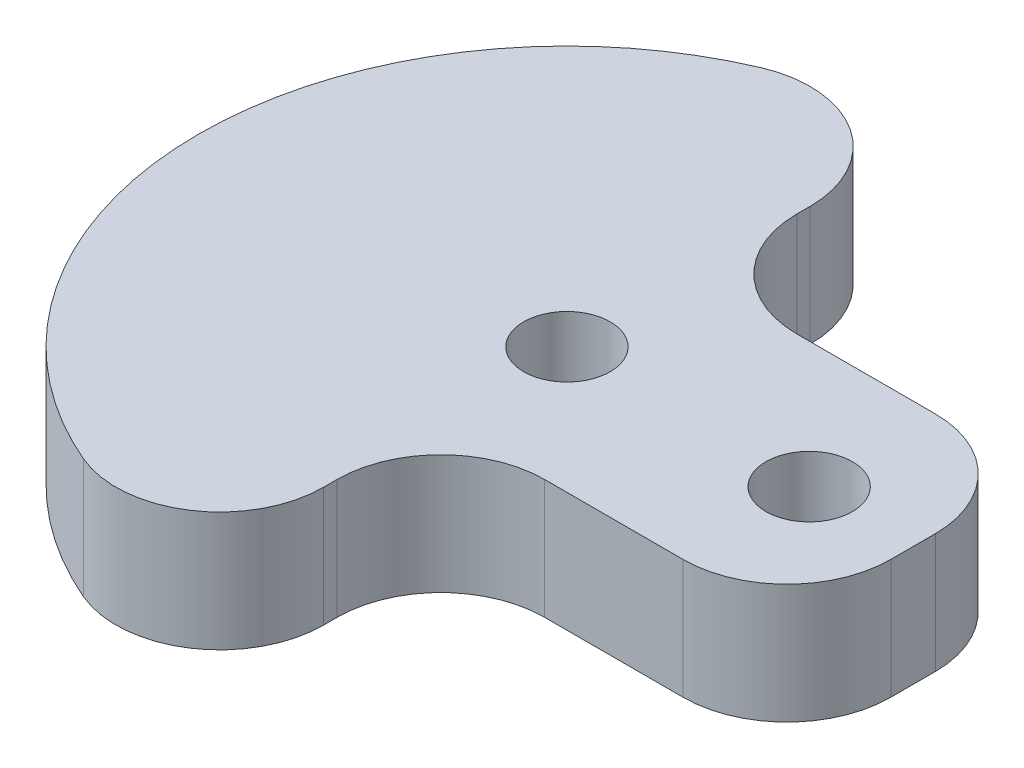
ISO-10303-21;
HEADER;
FILE_DESCRIPTION(('STEP AP214'),'2;1');
FILE_NAME('part.step','',(''),(''),'','','');
FILE_SCHEMA(('AUTOMOTIVE_DESIGN { 1 0 10303 214 1 1 1 1 }'));
ENDSEC;
DATA;
#1=APPLICATION_CONTEXT('core data for automotive mechanical design processes');
#2=APPLICATION_PROTOCOL_DEFINITION('international standard','automotive_design',2000,#1);
#3=PRODUCT_CONTEXT('',#1,'mechanical');
#4=PRODUCT('Part','Part','',(#3));
#5=PRODUCT_RELATED_PRODUCT_CATEGORY('part','',(#4));
#6=PRODUCT_DEFINITION_FORMATION('','',#4);
#7=PRODUCT_DEFINITION_CONTEXT('part definition',#1,'design');
#8=PRODUCT_DEFINITION('design','',#6,#7);
#9=PRODUCT_DEFINITION_SHAPE('','',#8);
#10=(LENGTH_UNIT() NAMED_UNIT(*) SI_UNIT(.MILLI.,.METRE.));
#11=(NAMED_UNIT(*) PLANE_ANGLE_UNIT() SI_UNIT($,.RADIAN.));
#12=(NAMED_UNIT(*) SI_UNIT($,.STERADIAN.) SOLID_ANGLE_UNIT());
#13=UNCERTAINTY_MEASURE_WITH_UNIT(LENGTH_MEASURE(1.E-05),#10,'distance_accuracy_value','');
#14=(GEOMETRIC_REPRESENTATION_CONTEXT(3) GLOBAL_UNCERTAINTY_ASSIGNED_CONTEXT((#13)) GLOBAL_UNIT_ASSIGNED_CONTEXT((#10,
#11,#12)) REPRESENTATION_CONTEXT('',''));
#15=CARTESIAN_POINT('',(0.,0.,0.));
#16=DIRECTION('',(0.,0.,1.));
#17=DIRECTION('',(1.,0.,0.));
#18=AXIS2_PLACEMENT_3D('',#15,#16,#17);
#19=CARTESIAN_POINT('',(7.62,8.763,16.8728571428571));
#20=DIRECTION('',(0.,1.,0.));
#21=DIRECTION('',(0.,0.,1.));
#22=AXIS2_PLACEMENT_3D('',#19,#20,#21);
#23=PLANE('',#22);
#24=CARTESIAN_POINT('',(0.,8.763,0.));
#25=DIRECTION('',(0.,1.,0.));
#26=DIRECTION('',(0.,0.,1.));
#27=AXIS2_PLACEMENT_3D('',#24,#25,#26);
#28=CIRCLE('',#27,3.175);
#29=CARTESIAN_POINT('',(0.,8.763,3.175));
#30=VERTEX_POINT('',#29);
#31=EDGE_CURVE('E157',#30,#30,#28,.T.);
#32=ORIENTED_EDGE('',*,*,#31,.F.);
#33=EDGE_LOOP('',(#32));
#34=FACE_BOUND('',#33,.T.);
#35=CARTESIAN_POINT('',(7.62,8.763,16.8728571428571));
#36=DIRECTION('',(0.,-1.,0.));
#37=DIRECTION('',(0.,0.,1.));
#38=AXIS2_PLACEMENT_3D('',#35,#36,#37);
#39=CIRCLE('',#38,7.62);
#40=CARTESIAN_POINT('',(0.,8.763,16.8728571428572));
#41=VERTEX_POINT('',#40);
#42=CARTESIAN_POINT('',(7.62000000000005,8.763,9.25285714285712));
#43=VERTEX_POINT('',#42);
#44=EDGE_CURVE('E176',#41,#43,#39,.T.);
#45=ORIENTED_EDGE('',*,*,#44,.T.);
#46=DIRECTION('',(1.,0.,0.));
#47=VECTOR('',#46,1.);
#48=CARTESIAN_POINT('',(17.7799999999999,8.763,9.25285714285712));
#49=LINE('',#48,#47);
#50=CARTESIAN_POINT('',(17.7799999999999,8.763,9.25285714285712));
#51=VERTEX_POINT('',#50);
#52=EDGE_CURVE('E104',#43,#51,#49,.T.);
#53=ORIENTED_EDGE('',*,*,#52,.T.);
#54=CARTESIAN_POINT('',(17.78,8.763,1.63285714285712));
#55=DIRECTION('',(0.,1.,0.));
#56=DIRECTION('',(0.,0.,-1.));
#57=AXIS2_PLACEMENT_3D('',#54,#55,#56);
#58=CIRCLE('',#57,7.62);
#59=CARTESIAN_POINT('',(25.4,8.763,1.63285714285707));
#60=VERTEX_POINT('',#59);
#61=EDGE_CURVE('E203',#51,#60,#58,.T.);
#62=ORIENTED_EDGE('',*,*,#61,.T.);
#63=DIRECTION('',(0.,0.,-1.));
#64=VECTOR('',#63,1.);
#65=CARTESIAN_POINT('',(25.4,8.763,-1.63285714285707));
#66=LINE('',#65,#64);
#67=CARTESIAN_POINT('',(25.4,8.763,-1.63285714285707));
#68=VERTEX_POINT('',#67);
#69=EDGE_CURVE('E222',#60,#68,#66,.T.);
#70=ORIENTED_EDGE('',*,*,#69,.T.);
#71=CARTESIAN_POINT('',(17.78,8.763,-1.63285714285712));
#72=DIRECTION('',(0.,1.,0.));
#73=DIRECTION('',(0.,0.,-1.));
#74=AXIS2_PLACEMENT_3D('',#71,#72,#73);
#75=CIRCLE('',#74,7.62);
#76=CARTESIAN_POINT('',(17.7799999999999,8.763,-9.25285714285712));
#77=VERTEX_POINT('',#76);
#78=EDGE_CURVE('E219',#68,#77,#75,.T.);
#79=ORIENTED_EDGE('',*,*,#78,.T.);
#80=DIRECTION('',(-1.,0.,0.));
#81=VECTOR('',#80,1.);
#82=CARTESIAN_POINT('',(7.62000000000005,8.763,-9.25285714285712));
#83=LINE('',#82,#81);
#84=CARTESIAN_POINT('',(7.62000000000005,8.763,-9.25285714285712));
#85=VERTEX_POINT('',#84);
#86=EDGE_CURVE('E221',#77,#85,#83,.T.);
#87=ORIENTED_EDGE('',*,*,#86,.T.);
#88=CARTESIAN_POINT('',(7.62,8.763,-16.8728571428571));
#89=DIRECTION('',(0.,-1.,0.));
#90=DIRECTION('',(0.,0.,1.));
#91=AXIS2_PLACEMENT_3D('',#88,#89,#90);
#92=CIRCLE('',#91,7.62);
#93=CARTESIAN_POINT('',(0.,8.763,-16.8728571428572));
#94=VERTEX_POINT('',#93);
#95=EDGE_CURVE('E224',#85,#94,#92,.T.);
#96=ORIENTED_EDGE('',*,*,#95,.T.);
#97=DIRECTION('',(0.,0.,-1.));
#98=VECTOR('',#97,1.);
#99=CARTESIAN_POINT('',(0.,8.763,-17.8548207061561));
#100=LINE('',#99,#98);
#101=CARTESIAN_POINT('',(0.,8.763,-17.8548207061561));
#102=VERTEX_POINT('',#101);
#103=EDGE_CURVE('E230',#94,#102,#100,.T.);
#104=ORIENTED_EDGE('',*,*,#103,.T.);
#105=CARTESIAN_POINT('',(-7.62,8.763,-17.8548207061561));
#106=DIRECTION('',(0.,1.,0.));
#107=DIRECTION('',(0.,0.,-1.));
#108=AXIS2_PLACEMENT_3D('',#105,#106,#107);
#109=CIRCLE('',#108,7.62);
#110=CARTESIAN_POINT('',(-10.6110280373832,8.763,-24.8632550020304));
#111=VERTEX_POINT('',#110);
#112=EDGE_CURVE('E135',#102,#111,#109,.T.);
#113=ORIENTED_EDGE('',*,*,#112,.T.);
#114=CARTESIAN_POINT('',(0.,8.763,0.));
#115=DIRECTION('',(0.,1.,0.));
#116=DIRECTION('',(0.,0.,-1.));
#117=AXIS2_PLACEMENT_3D('',#114,#115,#116);
#118=CIRCLE('',#117,27.0328571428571);
#119=CARTESIAN_POINT('',(-10.6110280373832,8.763,24.8632550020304));
#120=VERTEX_POINT('',#119);
#121=EDGE_CURVE('E129',#111,#120,#118,.T.);
#122=ORIENTED_EDGE('',*,*,#121,.T.);
#123=CARTESIAN_POINT('',(-7.62,8.763,17.8548207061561));
#124=DIRECTION('',(0.,1.,0.));
#125=DIRECTION('',(0.,0.,1.));
#126=AXIS2_PLACEMENT_3D('',#123,#124,#125);
#127=CIRCLE('',#126,7.62);
#128=CARTESIAN_POINT('',(0.,8.763,17.8548207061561));
#129=VERTEX_POINT('',#128);
#130=EDGE_CURVE('E133',#120,#129,#127,.T.);
#131=ORIENTED_EDGE('',*,*,#130,.T.);
#132=DIRECTION('',(0.,0.,-1.));
#133=VECTOR('',#132,1.);
#134=CARTESIAN_POINT('',(0.,8.763,16.8728571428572));
#135=LINE('',#134,#133);
#136=EDGE_CURVE('E49',#129,#41,#135,.T.);
#137=ORIENTED_EDGE('',*,*,#136,.T.);
#138=EDGE_LOOP('',(#45,#53,#62,#70,#79,#87,#96,#104,#113,#122,#131,#137));
#139=FACE_BOUND('',#138,.T.);
#140=CARTESIAN_POINT('',(17.78,8.763,0.));
#141=DIRECTION('',(0.,1.,0.));
#142=DIRECTION('',(0.,0.,1.));
#143=AXIS2_PLACEMENT_3D('',#140,#141,#142);
#144=CIRCLE('',#143,3.175);
#145=CARTESIAN_POINT('',(17.78,8.763,3.175));
#146=VERTEX_POINT('',#145);
#147=EDGE_CURVE('E273',#146,#146,#144,.T.);
#148=ORIENTED_EDGE('',*,*,#147,.F.);
#149=EDGE_LOOP('',(#148));
#150=FACE_BOUND('',#149,.T.);
#151=ADVANCED_FACE('F32',(#34,#139,#150),#23,.T.);
#152=CARTESIAN_POINT('',(7.62,0.,16.8728571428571));
#153=DIRECTION('',(0.,1.,0.));
#154=DIRECTION('',(0.,0.,1.));
#155=AXIS2_PLACEMENT_3D('',#152,#153,#154);
#156=PLANE('',#155);
#157=CARTESIAN_POINT('',(0.,0.,0.));
#158=DIRECTION('',(0.,1.,0.));
#159=DIRECTION('',(0.,0.,1.));
#160=AXIS2_PLACEMENT_3D('',#157,#158,#159);
#161=CIRCLE('',#160,3.175);
#162=CARTESIAN_POINT('',(0.,0.,3.175));
#163=VERTEX_POINT('',#162);
#164=EDGE_CURVE('E278',#163,#163,#161,.T.);
#165=ORIENTED_EDGE('',*,*,#164,.T.);
#166=EDGE_LOOP('',(#165));
#167=FACE_BOUND('',#166,.T.);
#168=CARTESIAN_POINT('',(7.62,0.,16.8728571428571));
#169=DIRECTION('',(0.,-1.,0.));
#170=DIRECTION('',(0.,0.,1.));
#171=AXIS2_PLACEMENT_3D('',#168,#169,#170);
#172=CIRCLE('',#171,7.62);
#173=CARTESIAN_POINT('',(0.,0.,16.8728571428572));
#174=VERTEX_POINT('',#173);
#175=CARTESIAN_POINT('',(7.62000000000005,0.,9.25285714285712));
#176=VERTEX_POINT('',#175);
#177=EDGE_CURVE('E153',#174,#176,#172,.T.);
#178=ORIENTED_EDGE('',*,*,#177,.F.);
#179=DIRECTION('',(0.,0.,-1.));
#180=VECTOR('',#179,1.);
#181=CARTESIAN_POINT('',(0.,0.,16.8728571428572));
#182=LINE('',#181,#180);
#183=CARTESIAN_POINT('',(0.,0.,17.8548207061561));
#184=VERTEX_POINT('',#183);
#185=EDGE_CURVE('E96',#184,#174,#182,.T.);
#186=ORIENTED_EDGE('',*,*,#185,.F.);
#187=CARTESIAN_POINT('',(-7.62,0.,17.8548207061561));
#188=DIRECTION('',(0.,1.,0.));
#189=DIRECTION('',(0.,0.,1.));
#190=AXIS2_PLACEMENT_3D('',#187,#188,#189);
#191=CIRCLE('',#190,7.62);
#192=CARTESIAN_POINT('',(-10.6110280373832,0.,24.8632550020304));
#193=VERTEX_POINT('',#192);
#194=EDGE_CURVE('E90',#193,#184,#191,.T.);
#195=ORIENTED_EDGE('',*,*,#194,.F.);
#196=CARTESIAN_POINT('',(0.,0.,0.));
#197=DIRECTION('',(0.,1.,0.));
#198=DIRECTION('',(0.,0.,-1.));
#199=AXIS2_PLACEMENT_3D('',#196,#197,#198);
#200=CIRCLE('',#199,27.0328571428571);
#201=CARTESIAN_POINT('',(-10.6110280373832,0.,-24.8632550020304));
#202=VERTEX_POINT('',#201);
#203=EDGE_CURVE('E143',#202,#193,#200,.T.);
#204=ORIENTED_EDGE('',*,*,#203,.F.);
#205=CARTESIAN_POINT('',(-7.62,0.,-17.8548207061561));
#206=DIRECTION('',(0.,1.,0.));
#207=DIRECTION('',(0.,0.,-1.));
#208=AXIS2_PLACEMENT_3D('',#205,#206,#207);
#209=CIRCLE('',#208,7.62);
#210=CARTESIAN_POINT('',(0.,0.,-17.8548207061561));
#211=VERTEX_POINT('',#210);
#212=EDGE_CURVE('E171',#211,#202,#209,.T.);
#213=ORIENTED_EDGE('',*,*,#212,.F.);
#214=DIRECTION('',(0.,0.,-1.));
#215=VECTOR('',#214,1.);
#216=CARTESIAN_POINT('',(0.,0.,-17.8548207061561));
#217=LINE('',#216,#215);
#218=CARTESIAN_POINT('',(0.,0.,-16.8728571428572));
#219=VERTEX_POINT('',#218);
#220=EDGE_CURVE('E169',#219,#211,#217,.T.);
#221=ORIENTED_EDGE('',*,*,#220,.F.);
#222=CARTESIAN_POINT('',(7.62,0.,-16.8728571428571));
#223=DIRECTION('',(0.,-1.,0.));
#224=DIRECTION('',(0.,0.,1.));
#225=AXIS2_PLACEMENT_3D('',#222,#223,#224);
#226=CIRCLE('',#225,7.62);
#227=CARTESIAN_POINT('',(7.62000000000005,0.,-9.25285714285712));
#228=VERTEX_POINT('',#227);
#229=EDGE_CURVE('E167',#228,#219,#226,.T.);
#230=ORIENTED_EDGE('',*,*,#229,.F.);
#231=DIRECTION('',(-1.,0.,0.));
#232=VECTOR('',#231,1.);
#233=CARTESIAN_POINT('',(7.62000000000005,0.,-9.25285714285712));
#234=LINE('',#233,#232);
#235=CARTESIAN_POINT('',(17.7799999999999,0.,-9.25285714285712));
#236=VERTEX_POINT('',#235);
#237=EDGE_CURVE('E165',#236,#228,#234,.T.);
#238=ORIENTED_EDGE('',*,*,#237,.F.);
#239=CARTESIAN_POINT('',(17.78,0.,-1.63285714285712));
#240=DIRECTION('',(0.,1.,0.));
#241=DIRECTION('',(0.,0.,-1.));
#242=AXIS2_PLACEMENT_3D('',#239,#240,#241);
#243=CIRCLE('',#242,7.62);
#244=CARTESIAN_POINT('',(25.4,0.,-1.63285714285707));
#245=VERTEX_POINT('',#244);
#246=EDGE_CURVE('E163',#245,#236,#243,.T.);
#247=ORIENTED_EDGE('',*,*,#246,.F.);
#248=DIRECTION('',(0.,0.,-1.));
#249=VECTOR('',#248,1.);
#250=CARTESIAN_POINT('',(25.4,0.,-1.63285714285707));
#251=LINE('',#250,#249);
#252=CARTESIAN_POINT('',(25.4,0.,1.63285714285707));
#253=VERTEX_POINT('',#252);
#254=EDGE_CURVE('E161',#253,#245,#251,.T.);
#255=ORIENTED_EDGE('',*,*,#254,.F.);
#256=CARTESIAN_POINT('',(17.78,0.,1.63285714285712));
#257=DIRECTION('',(0.,1.,0.));
#258=DIRECTION('',(0.,0.,-1.));
#259=AXIS2_PLACEMENT_3D('',#256,#257,#258);
#260=CIRCLE('',#259,7.62);
#261=CARTESIAN_POINT('',(17.7799999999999,0.,9.25285714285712));
#262=VERTEX_POINT('',#261);
#263=EDGE_CURVE('E159',#262,#253,#260,.T.);
#264=ORIENTED_EDGE('',*,*,#263,.F.);
#265=DIRECTION('',(1.,0.,0.));
#266=VECTOR('',#265,1.);
#267=CARTESIAN_POINT('',(17.7799999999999,0.,9.25285714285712));
#268=LINE('',#267,#266);
#269=EDGE_CURVE('E156',#176,#262,#268,.T.);
#270=ORIENTED_EDGE('',*,*,#269,.F.);
#271=EDGE_LOOP('',(#178,#186,#195,#204,#213,#221,#230,#238,#247,#255,#264,#270));
#272=FACE_BOUND('',#271,.T.);
#273=CARTESIAN_POINT('',(17.78,0.,0.));
#274=DIRECTION('',(0.,1.,0.));
#275=DIRECTION('',(0.,0.,1.));
#276=AXIS2_PLACEMENT_3D('',#273,#274,#275);
#277=CIRCLE('',#276,3.175);
#278=CARTESIAN_POINT('',(17.78,0.,3.175));
#279=VERTEX_POINT('',#278);
#280=EDGE_CURVE('E276',#279,#279,#277,.T.);
#281=ORIENTED_EDGE('',*,*,#280,.T.);
#282=EDGE_LOOP('',(#281));
#283=FACE_BOUND('',#282,.T.);
#284=ADVANCED_FACE('F207',(#167,#272,#283),#156,.F.);
#285=CARTESIAN_POINT('',(7.62,8.763,16.8728571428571));
#286=DIRECTION('',(0.,-1.,0.));
#287=DIRECTION('',(0.,0.,-1.));
#288=AXIS2_PLACEMENT_3D('',#285,#286,#287);
#289=CYLINDRICAL_SURFACE('',#288,7.62);
#290=ORIENTED_EDGE('',*,*,#177,.T.);
#291=DIRECTION('',(0.,-1.,0.));
#292=VECTOR('',#291,1.);
#293=CARTESIAN_POINT('',(7.62000000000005,8.763,9.25285714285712));
#294=LINE('',#293,#292);
#295=EDGE_CURVE('E11',#43,#176,#294,.T.);
#296=ORIENTED_EDGE('',*,*,#295,.F.);
#297=ORIENTED_EDGE('',*,*,#44,.F.);
#298=DIRECTION('',(0.,-1.,0.));
#299=VECTOR('',#298,1.);
#300=CARTESIAN_POINT('',(0.,8.763,16.8728571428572));
#301=LINE('',#300,#299);
#302=EDGE_CURVE('E149',#41,#174,#301,.T.);
#303=ORIENTED_EDGE('',*,*,#302,.T.);
#304=EDGE_LOOP('',(#290,#296,#297,#303));
#305=FACE_BOUND('',#304,.T.);
#306=ADVANCED_FACE('F34',(#305),#289,.F.);
#307=CARTESIAN_POINT('',(17.7799999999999,8.763,9.25285714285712));
#308=DIRECTION('',(0.,0.,-1.));
#309=DIRECTION('',(-1.,0.,0.));
#310=AXIS2_PLACEMENT_3D('',#307,#308,#309);
#311=PLANE('',#310);
#312=ORIENTED_EDGE('',*,*,#269,.T.);
#313=DIRECTION('',(0.,-1.,0.));
#314=VECTOR('',#313,1.);
#315=CARTESIAN_POINT('',(17.7799999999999,8.763,9.25285714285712));
#316=LINE('',#315,#314);
#317=EDGE_CURVE('E41',#51,#262,#316,.T.);
#318=ORIENTED_EDGE('',*,*,#317,.F.);
#319=ORIENTED_EDGE('',*,*,#52,.F.);
#320=ORIENTED_EDGE('',*,*,#295,.T.);
#321=EDGE_LOOP('',(#312,#318,#319,#320));
#322=FACE_BOUND('',#321,.T.);
#323=ADVANCED_FACE('F371',(#322),#311,.F.);
#324=CARTESIAN_POINT('',(17.78,8.763,1.63285714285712));
#325=DIRECTION('',(0.,-1.,0.));
#326=DIRECTION('',(0.,0.,-1.));
#327=AXIS2_PLACEMENT_3D('',#324,#325,#326);
#328=CYLINDRICAL_SURFACE('',#327,7.62);
#329=ORIENTED_EDGE('',*,*,#263,.T.);
#330=DIRECTION('',(0.,-1.,0.));
#331=VECTOR('',#330,1.);
#332=CARTESIAN_POINT('',(25.4,8.763,1.63285714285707));
#333=LINE('',#332,#331);
#334=EDGE_CURVE('E195',#60,#253,#333,.T.);
#335=ORIENTED_EDGE('',*,*,#334,.F.);
#336=ORIENTED_EDGE('',*,*,#61,.F.);
#337=ORIENTED_EDGE('',*,*,#317,.T.);
#338=EDGE_LOOP('',(#329,#335,#336,#337));
#339=FACE_BOUND('',#338,.T.);
#340=ADVANCED_FACE('F201',(#339),#328,.T.);
#341=CARTESIAN_POINT('',(25.4,8.763,-1.63285714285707));
#342=DIRECTION('',(-1.,0.,0.));
#343=DIRECTION('',(0.,0.,1.));
#344=AXIS2_PLACEMENT_3D('',#341,#342,#343);
#345=PLANE('',#344);
#346=ORIENTED_EDGE('',*,*,#254,.T.);
#347=DIRECTION('',(0.,-1.,0.));
#348=VECTOR('',#347,1.);
#349=CARTESIAN_POINT('',(25.4,8.763,-1.63285714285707));
#350=LINE('',#349,#348);
#351=EDGE_CURVE('E192',#68,#245,#350,.T.);
#352=ORIENTED_EDGE('',*,*,#351,.F.);
#353=ORIENTED_EDGE('',*,*,#69,.F.);
#354=ORIENTED_EDGE('',*,*,#334,.T.);
#355=EDGE_LOOP('',(#346,#352,#353,#354));
#356=FACE_BOUND('',#355,.T.);
#357=ADVANCED_FACE('F213',(#356),#345,.F.);
#358=CARTESIAN_POINT('',(17.78,8.763,-1.63285714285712));
#359=DIRECTION('',(0.,-1.,0.));
#360=DIRECTION('',(0.,0.,-1.));
#361=AXIS2_PLACEMENT_3D('',#358,#359,#360);
#362=CYLINDRICAL_SURFACE('',#361,7.62);
#363=ORIENTED_EDGE('',*,*,#246,.T.);
#364=DIRECTION('',(0.,-1.,0.));
#365=VECTOR('',#364,1.);
#366=CARTESIAN_POINT('',(17.7799999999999,8.763,-9.25285714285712));
#367=LINE('',#366,#365);
#368=EDGE_CURVE('E189',#77,#236,#367,.T.);
#369=ORIENTED_EDGE('',*,*,#368,.F.);
#370=ORIENTED_EDGE('',*,*,#78,.F.);
#371=ORIENTED_EDGE('',*,*,#351,.T.);
#372=EDGE_LOOP('',(#363,#369,#370,#371));
#373=FACE_BOUND('',#372,.T.);
#374=ADVANCED_FACE('F217',(#373),#362,.T.);
#375=CARTESIAN_POINT('',(7.62000000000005,8.763,-9.25285714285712));
#376=DIRECTION('',(0.,0.,1.));
#377=DIRECTION('',(1.,0.,0.));
#378=AXIS2_PLACEMENT_3D('',#375,#376,#377);
#379=PLANE('',#378);
#380=ORIENTED_EDGE('',*,*,#237,.T.);
#381=DIRECTION('',(0.,-1.,0.));
#382=VECTOR('',#381,1.);
#383=CARTESIAN_POINT('',(7.62000000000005,8.763,-9.25285714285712));
#384=LINE('',#383,#382);
#385=EDGE_CURVE('E186',#85,#228,#384,.T.);
#386=ORIENTED_EDGE('',*,*,#385,.F.);
#387=ORIENTED_EDGE('',*,*,#86,.F.);
#388=ORIENTED_EDGE('',*,*,#368,.T.);
#389=EDGE_LOOP('',(#380,#386,#387,#388));
#390=FACE_BOUND('',#389,.T.);
#391=ADVANCED_FACE('F336',(#390),#379,.F.);
#392=CARTESIAN_POINT('',(7.62,8.763,-16.8728571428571));
#393=DIRECTION('',(0.,-1.,0.));
#394=DIRECTION('',(0.,0.,-1.));
#395=AXIS2_PLACEMENT_3D('',#392,#393,#394);
#396=CYLINDRICAL_SURFACE('',#395,7.62);
#397=ORIENTED_EDGE('',*,*,#229,.T.);
#398=DIRECTION('',(0.,-1.,0.));
#399=VECTOR('',#398,1.);
#400=CARTESIAN_POINT('',(0.,8.763,-16.8728571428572));
#401=LINE('',#400,#399);
#402=EDGE_CURVE('E183',#94,#219,#401,.T.);
#403=ORIENTED_EDGE('',*,*,#402,.F.);
#404=ORIENTED_EDGE('',*,*,#95,.F.);
#405=ORIENTED_EDGE('',*,*,#385,.T.);
#406=EDGE_LOOP('',(#397,#403,#404,#405));
#407=FACE_BOUND('',#406,.T.);
#408=ADVANCED_FACE('F327',(#407),#396,.F.);
#409=CARTESIAN_POINT('',(0.,8.763,-17.8548207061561));
#410=DIRECTION('',(-1.,0.,0.));
#411=DIRECTION('',(0.,0.,1.));
#412=AXIS2_PLACEMENT_3D('',#409,#410,#411);
#413=PLANE('',#412);
#414=ORIENTED_EDGE('',*,*,#220,.T.);
#415=DIRECTION('',(0.,-1.,0.));
#416=VECTOR('',#415,1.);
#417=CARTESIAN_POINT('',(0.,8.763,-17.8548207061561));
#418=LINE('',#417,#416);
#419=EDGE_CURVE('E180',#102,#211,#418,.T.);
#420=ORIENTED_EDGE('',*,*,#419,.F.);
#421=ORIENTED_EDGE('',*,*,#103,.F.);
#422=ORIENTED_EDGE('',*,*,#402,.T.);
#423=EDGE_LOOP('',(#414,#420,#421,#422));
#424=FACE_BOUND('',#423,.T.);
#425=ADVANCED_FACE('F236',(#424),#413,.F.);
#426=CARTESIAN_POINT('',(-7.62,8.763,-17.8548207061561));
#427=DIRECTION('',(0.,-1.,0.));
#428=DIRECTION('',(0.,0.,-1.));
#429=AXIS2_PLACEMENT_3D('',#426,#427,#428);
#430=CYLINDRICAL_SURFACE('',#429,7.62);
#431=ORIENTED_EDGE('',*,*,#212,.T.);
#432=DIRECTION('',(0.,-1.,0.));
#433=VECTOR('',#432,1.);
#434=CARTESIAN_POINT('',(-10.6110280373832,8.763,-24.8632550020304));
#435=LINE('',#434,#433);
#436=EDGE_CURVE('E144',#111,#202,#435,.T.);
#437=ORIENTED_EDGE('',*,*,#436,.F.);
#438=ORIENTED_EDGE('',*,*,#112,.F.);
#439=ORIENTED_EDGE('',*,*,#419,.T.);
#440=EDGE_LOOP('',(#431,#437,#438,#439));
#441=FACE_BOUND('',#440,.T.);
#442=ADVANCED_FACE('F240',(#441),#430,.T.);
#443=CARTESIAN_POINT('',(0.,8.763,0.));
#444=DIRECTION('',(0.,-1.,0.));
#445=DIRECTION('',(0.,0.,-1.));
#446=AXIS2_PLACEMENT_3D('',#443,#444,#445);
#447=CYLINDRICAL_SURFACE('',#446,27.0328571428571);
#448=ORIENTED_EDGE('',*,*,#203,.T.);
#449=DIRECTION('',(0.,-1.,0.));
#450=VECTOR('',#449,1.);
#451=CARTESIAN_POINT('',(-10.6110280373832,8.763,24.8632550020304));
#452=LINE('',#451,#450);
#453=EDGE_CURVE('E140',#120,#193,#452,.T.);
#454=ORIENTED_EDGE('',*,*,#453,.F.);
#455=ORIENTED_EDGE('',*,*,#121,.F.);
#456=ORIENTED_EDGE('',*,*,#436,.T.);
#457=EDGE_LOOP('',(#448,#454,#455,#456));
#458=FACE_BOUND('',#457,.T.);
#459=ADVANCED_FACE('F141',(#458),#447,.T.);
#460=CARTESIAN_POINT('',(-7.62,8.763,17.8548207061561));
#461=DIRECTION('',(0.,-1.,0.));
#462=DIRECTION('',(0.,0.,-1.));
#463=AXIS2_PLACEMENT_3D('',#460,#461,#462);
#464=CYLINDRICAL_SURFACE('',#463,7.62);
#465=ORIENTED_EDGE('',*,*,#194,.T.);
#466=DIRECTION('',(0.,-1.,0.));
#467=VECTOR('',#466,1.);
#468=CARTESIAN_POINT('',(0.,8.763,17.8548207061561));
#469=LINE('',#468,#467);
#470=EDGE_CURVE('E145',#129,#184,#469,.T.);
#471=ORIENTED_EDGE('',*,*,#470,.F.);
#472=ORIENTED_EDGE('',*,*,#130,.F.);
#473=ORIENTED_EDGE('',*,*,#453,.T.);
#474=EDGE_LOOP('',(#465,#471,#472,#473));
#475=FACE_BOUND('',#474,.T.);
#476=ADVANCED_FACE('F147',(#475),#464,.T.);
#477=CARTESIAN_POINT('',(0.,8.763,16.8728571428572));
#478=DIRECTION('',(-1.,0.,0.));
#479=DIRECTION('',(0.,0.,1.));
#480=AXIS2_PLACEMENT_3D('',#477,#478,#479);
#481=PLANE('',#480);
#482=ORIENTED_EDGE('',*,*,#185,.T.);
#483=ORIENTED_EDGE('',*,*,#302,.F.);
#484=ORIENTED_EDGE('',*,*,#136,.F.);
#485=ORIENTED_EDGE('',*,*,#470,.T.);
#486=EDGE_LOOP('',(#482,#483,#484,#485));
#487=FACE_BOUND('',#486,.T.);
#488=ADVANCED_FACE('F244',(#487),#481,.F.);
#489=CARTESIAN_POINT('',(0.,8.763,0.));
#490=DIRECTION('',(0.,-1.,0.));
#491=DIRECTION('',(0.,0.,-1.));
#492=AXIS2_PLACEMENT_3D('',#489,#490,#491);
#493=CYLINDRICAL_SURFACE('',#492,3.175);
#494=ORIENTED_EDGE('',*,*,#31,.T.);
#495=EDGE_LOOP('',(#494));
#496=FACE_BOUND('',#495,.T.);
#497=ORIENTED_EDGE('',*,*,#164,.F.);
#498=EDGE_LOOP('',(#497));
#499=FACE_BOUND('',#498,.T.);
#500=ADVANCED_FACE('F246',(#496,#499),#493,.F.);
#501=CARTESIAN_POINT('',(17.78,8.763,0.));
#502=DIRECTION('',(0.,-1.,0.));
#503=DIRECTION('',(0.,0.,-1.));
#504=AXIS2_PLACEMENT_3D('',#501,#502,#503);
#505=CYLINDRICAL_SURFACE('',#504,3.175);
#506=ORIENTED_EDGE('',*,*,#147,.T.);
#507=EDGE_LOOP('',(#506));
#508=FACE_BOUND('',#507,.T.);
#509=ORIENTED_EDGE('',*,*,#280,.F.);
#510=EDGE_LOOP('',(#509));
#511=FACE_BOUND('',#510,.T.);
#512=ADVANCED_FACE('F252',(#508,#511),#505,.F.);
#513=CLOSED_SHELL('',(#151,#284,#306,#323,#340,#357,#374,#391,#408,#425,#442,#459,#476,#488,
#500,#512));
#514=MANIFOLD_SOLID_BREP('B2',#513);
#515=ADVANCED_BREP_SHAPE_REPRESENTATION('',(#18,#514),#14);
#516=SHAPE_DEFINITION_REPRESENTATION(#9,#515);
ENDSEC;
END-ISO-10303-21;
